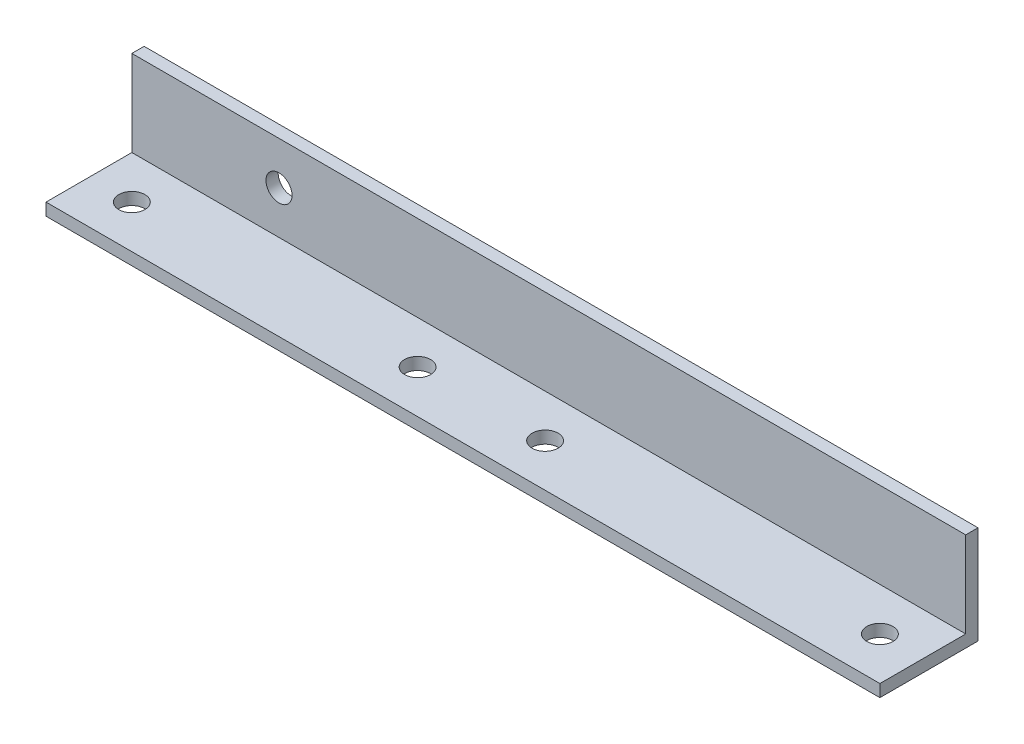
from build123d import *

# Parameters (mm, degrees)
SKETCH1_W           = 215.9
SKETCH1_H           = 25.4
BOSS_EXTRUDE1_DEPTH = 3.175
SKETCH2_W           = 215.9
SKETCH2_H           = 3.175
BOSS_EXTRUDE2_DEPTH = 22.225
SKETCH3_R           = 3.3782
CUT_EXTRUDE1_DEPTH  = 111.943423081
SKETCH4_R           = 3.3782
CUT_EXTRUDE2_DEPTH  = 114.103108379


with BuildPart() as part:
    # Sketch1 → Boss-Extrude1 (new body)
    with BuildSketch(Plane(origin=(0, 0, 0), x_dir=(1, 0, 0), z_dir=(0, 1, 0))):
        Rectangle(SKETCH1_W, SKETCH1_H)
    extrude(amount=BOSS_EXTRUDE1_DEPTH)

    # Sketch2 → Boss-Extrude2 (add)
    with BuildSketch(Plane(origin=(0, 3.175, 0), x_dir=(1, 0, 0), z_dir=(0, 1, 0))):
        with Locations((0, 11.1125)):
            Rectangle(SKETCH2_W, SKETCH2_H)
    extrude(amount=BOSS_EXTRUDE2_DEPTH)

    # Sketch3 → Cut-Extrude1 (cut, through all)
    with BuildSketch(Plane(origin=(0, 3.175, 0), x_dir=(1, 0, 0), z_dir=(0, 1, 0))):
        with Locations(Location((-96.8375, -1.5875, 0), (0, 0, 270))):
            Circle(SKETCH3_R)
        with Locations(Location((10.16, -1.5875, 0), (0, 0, 270))):
            Circle(SKETCH3_R)
        with Locations(Location((96.8375, -1.5875, 0), (0, 0, 270))):
            Circle(SKETCH3_R)
        with Locations(Location((-22.86, -1.5875, 0), (0, 0, 270))):
            Circle(SKETCH3_R)
    extrude(amount=-CUT_EXTRUDE1_DEPTH, mode=Mode.SUBTRACT)

    # Sketch4 → Cut-Extrude2 (cut, through all)
    with BuildSketch(Plane.XY.offset(-9.525)):
        with Locations((-69.85, 14.2875)):
            Circle(SKETCH4_R)
    extrude(amount=-CUT_EXTRUDE2_DEPTH, mode=Mode.SUBTRACT)


solid = part.part
